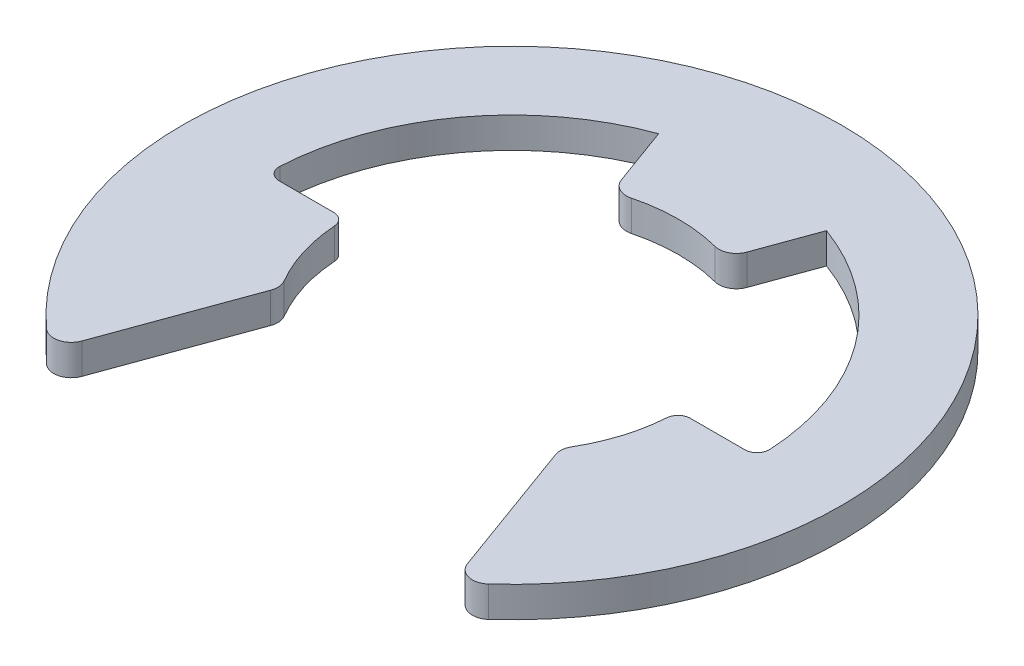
ISO-10303-21;
HEADER;
FILE_DESCRIPTION(('STEP AP214'),'2;1');
FILE_NAME('part.step','',(''),(''),'','','');
FILE_SCHEMA(('AUTOMOTIVE_DESIGN { 1 0 10303 214 1 1 1 1 }'));
ENDSEC;
DATA;
#1=APPLICATION_CONTEXT('core data for automotive mechanical design processes');
#2=APPLICATION_PROTOCOL_DEFINITION('international standard','automotive_design',2000,#1);
#3=PRODUCT_CONTEXT('',#1,'mechanical');
#4=PRODUCT('Part','Part','',(#3));
#5=PRODUCT_RELATED_PRODUCT_CATEGORY('part','',(#4));
#6=PRODUCT_DEFINITION_FORMATION('','',#4);
#7=PRODUCT_DEFINITION_CONTEXT('part definition',#1,'design');
#8=PRODUCT_DEFINITION('design','',#6,#7);
#9=PRODUCT_DEFINITION_SHAPE('','',#8);
#10=(LENGTH_UNIT() NAMED_UNIT(*) SI_UNIT(.MILLI.,.METRE.));
#11=(NAMED_UNIT(*) PLANE_ANGLE_UNIT() SI_UNIT($,.RADIAN.));
#12=(NAMED_UNIT(*) SI_UNIT($,.STERADIAN.) SOLID_ANGLE_UNIT());
#13=UNCERTAINTY_MEASURE_WITH_UNIT(LENGTH_MEASURE(1.E-05),#10,'distance_accuracy_value','');
#14=(GEOMETRIC_REPRESENTATION_CONTEXT(3) GLOBAL_UNCERTAINTY_ASSIGNED_CONTEXT((#13)) GLOBAL_UNIT_ASSIGNED_CONTEXT((#10,
#11,#12)) REPRESENTATION_CONTEXT('',''));
#15=CARTESIAN_POINT('',(0.,0.,0.));
#16=DIRECTION('',(0.,0.,1.));
#17=DIRECTION('',(1.,0.,0.));
#18=AXIS2_PLACEMENT_3D('',#15,#16,#17);
#19=CARTESIAN_POINT('',(0.,0.875,0.));
#20=DIRECTION('',(0.,-1.,0.));
#21=DIRECTION('',(0.,0.,-1.));
#22=AXIS2_PLACEMENT_3D('',#19,#20,#21);
#23=CYLINDRICAL_SURFACE('',#22,14.);
#24=CARTESIAN_POINT('',(0.,0.875,0.));
#25=DIRECTION('',(0.,-1.,0.));
#26=DIRECTION('',(0.,0.,1.));
#27=AXIS2_PLACEMENT_3D('',#24,#25,#26);
#28=CIRCLE('',#27,14.);
#29=CARTESIAN_POINT('',(-13.9805959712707,0.875,-0.736842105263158));
#30=VERTEX_POINT('',#29);
#31=CARTESIAN_POINT('',(-4.78828200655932,0.875,-13.1556966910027));
#32=VERTEX_POINT('',#31);
#33=EDGE_CURVE('E187',#30,#32,#28,.T.);
#34=ORIENTED_EDGE('',*,*,#33,.F.);
#35=DIRECTION('',(0.,-1.,0.));
#36=VECTOR('',#35,1.);
#37=CARTESIAN_POINT('',(-13.9805959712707,0.875,-0.736842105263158));
#38=LINE('',#37,#36);
#39=CARTESIAN_POINT('',(-13.9805959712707,-0.875,-0.736842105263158));
#40=VERTEX_POINT('',#39);
#41=EDGE_CURVE('E327',#30,#40,#38,.T.);
#42=ORIENTED_EDGE('',*,*,#41,.T.);
#43=CARTESIAN_POINT('',(0.,-0.875,0.));
#44=DIRECTION('',(0.,-1.,0.));
#45=DIRECTION('',(0.,0.,1.));
#46=AXIS2_PLACEMENT_3D('',#43,#44,#45);
#47=CIRCLE('',#46,14.);
#48=CARTESIAN_POINT('',(-4.78828200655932,-0.875,-13.1556966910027));
#49=VERTEX_POINT('',#48);
#50=EDGE_CURVE('E211',#40,#49,#47,.T.);
#51=ORIENTED_EDGE('',*,*,#50,.T.);
#52=DIRECTION('',(0.,-1.,0.));
#53=VECTOR('',#52,1.);
#54=CARTESIAN_POINT('',(-4.78828200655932,0.875,-13.1556966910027));
#55=LINE('',#54,#53);
#56=EDGE_CURVE('E204',#32,#49,#55,.T.);
#57=ORIENTED_EDGE('',*,*,#56,.F.);
#58=EDGE_LOOP('',(#34,#42,#51,#57));
#59=FACE_BOUND('',#58,.T.);
#60=ADVANCED_FACE('F39',(#59),#23,.F.);
#61=CARTESIAN_POINT('',(-4.78828200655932,0.875,-13.1556966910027));
#62=DIRECTION('',(0.93969262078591,0.,-0.342020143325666));
#63=DIRECTION('',(-0.342020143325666,0.,-0.93969262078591));
#64=AXIS2_PLACEMENT_3D('',#61,#62,#63);
#65=PLANE('',#64);
#66=DIRECTION('',(0.342020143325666,0.,0.93969262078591));
#67=VECTOR('',#66,1.);
#68=CARTESIAN_POINT('',(-4.78828200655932,-0.875,-13.1556966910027));
#69=LINE('',#68,#67);
#70=CARTESIAN_POINT('',(-3.57488773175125,-0.875,-9.82192332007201));
#71=VERTEX_POINT('',#70);
#72=EDGE_CURVE('E448',#49,#71,#69,.T.);
#73=ORIENTED_EDGE('',*,*,#72,.T.);
#74=DIRECTION('',(0.,-1.,0.));
#75=VECTOR('',#74,1.);
#76=CARTESIAN_POINT('',(-3.57488773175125,0.875,-9.82192332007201));
#77=LINE('',#76,#75);
#78=CARTESIAN_POINT('',(-3.57488773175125,0.875,-9.82192332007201));
#79=VERTEX_POINT('',#78);
#80=EDGE_CURVE('E206',#71,#79,#77,.F.);
#81=ORIENTED_EDGE('',*,*,#80,.T.);
#82=DIRECTION('',(0.342020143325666,0.,0.93969262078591));
#83=VECTOR('',#82,1.);
#84=CARTESIAN_POINT('',(-4.78828200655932,0.875,-13.1556966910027));
#85=LINE('',#84,#83);
#86=EDGE_CURVE('E191',#32,#79,#85,.T.);
#87=ORIENTED_EDGE('',*,*,#86,.F.);
#88=ORIENTED_EDGE('',*,*,#56,.T.);
#89=EDGE_LOOP('',(#73,#81,#87,#88));
#90=FACE_BOUND('',#89,.T.);
#91=ADVANCED_FACE('F203',(#90),#65,.F.);
#92=CARTESIAN_POINT('',(0.,0.875,0.));
#93=DIRECTION('',(0.,-1.,0.));
#94=DIRECTION('',(0.,0.,-1.));
#95=AXIS2_PLACEMENT_3D('',#92,#93,#94);
#96=CYLINDRICAL_SURFACE('',#95,9.5);
#97=CARTESIAN_POINT('',(0.,-0.875,0.));
#98=DIRECTION('',(0.,-1.,0.));
#99=DIRECTION('',(0.,0.,1.));
#100=AXIS2_PLACEMENT_3D('',#97,#98,#99);
#101=CIRCLE('',#100,9.5);
#102=CARTESIAN_POINT('',(-2.38422414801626,-0.875,-9.19594884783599));
#103=VERTEX_POINT('',#102);
#104=CARTESIAN_POINT('',(2.38422414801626,-0.875,-9.19594884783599));
#105=VERTEX_POINT('',#104);
#106=EDGE_CURVE('E451',#103,#105,#101,.T.);
#107=ORIENTED_EDGE('',*,*,#106,.T.);
#108=DIRECTION('',(0.,-1.,0.));
#109=VECTOR('',#108,1.);
#110=CARTESIAN_POINT('',(2.38422414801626,0.875,-9.19594884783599));
#111=LINE('',#110,#109);
#112=CARTESIAN_POINT('',(2.38422414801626,0.875,-9.19594884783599));
#113=VERTEX_POINT('',#112);
#114=EDGE_CURVE('E289',#105,#113,#111,.F.);
#115=ORIENTED_EDGE('',*,*,#114,.T.);
#116=CARTESIAN_POINT('',(0.,0.875,0.));
#117=DIRECTION('',(0.,-1.,0.));
#118=DIRECTION('',(0.,0.,1.));
#119=AXIS2_PLACEMENT_3D('',#116,#117,#118);
#120=CIRCLE('',#119,9.5);
#121=CARTESIAN_POINT('',(-2.38422414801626,0.875,-9.19594884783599));
#122=VERTEX_POINT('',#121);
#123=EDGE_CURVE('E208',#122,#113,#120,.T.);
#124=ORIENTED_EDGE('',*,*,#123,.F.);
#125=DIRECTION('',(0.,-1.,0.));
#126=VECTOR('',#125,1.);
#127=CARTESIAN_POINT('',(-2.38422414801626,0.875,-9.19594884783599));
#128=LINE('',#127,#126);
#129=EDGE_CURVE('E285',#122,#103,#128,.T.);
#130=ORIENTED_EDGE('',*,*,#129,.T.);
#131=EDGE_LOOP('',(#107,#115,#124,#130));
#132=FACE_BOUND('',#131,.T.);
#133=ADVANCED_FACE('F371',(#132),#96,.F.);
#134=CARTESIAN_POINT('',(3.24919136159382,0.875,-8.92707989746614));
#135=DIRECTION('',(-0.93969262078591,0.,-0.342020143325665));
#136=DIRECTION('',(-0.342020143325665,0.,0.93969262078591));
#137=AXIS2_PLACEMENT_3D('',#134,#135,#136);
#138=PLANE('',#137);
#139=DIRECTION('',(0.342020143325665,0.,-0.93969262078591));
#140=VECTOR('',#139,1.);
#141=CARTESIAN_POINT('',(3.24919136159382,0.875,-8.92707989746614));
#142=LINE('',#141,#140);
#143=CARTESIAN_POINT('',(3.57488773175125,0.875,-9.82192332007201));
#144=VERTEX_POINT('',#143);
#145=CARTESIAN_POINT('',(4.78828200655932,0.875,-13.1556966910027));
#146=VERTEX_POINT('',#145);
#147=EDGE_CURVE('E425',#144,#146,#142,.T.);
#148=ORIENTED_EDGE('',*,*,#147,.F.);
#149=DIRECTION('',(0.,-1.,0.));
#150=VECTOR('',#149,1.);
#151=CARTESIAN_POINT('',(3.57488773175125,0.875,-9.82192332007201));
#152=LINE('',#151,#150);
#153=CARTESIAN_POINT('',(3.57488773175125,-0.875,-9.82192332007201));
#154=VERTEX_POINT('',#153);
#155=EDGE_CURVE('E281',#144,#154,#152,.T.);
#156=ORIENTED_EDGE('',*,*,#155,.T.);
#157=DIRECTION('',(0.342020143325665,0.,-0.93969262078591));
#158=VECTOR('',#157,1.);
#159=CARTESIAN_POINT('',(3.24919136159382,-0.875,-8.92707989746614));
#160=LINE('',#159,#158);
#161=CARTESIAN_POINT('',(4.78828200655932,-0.875,-13.1556966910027));
#162=VERTEX_POINT('',#161);
#163=EDGE_CURVE('E454',#154,#162,#160,.T.);
#164=ORIENTED_EDGE('',*,*,#163,.T.);
#165=DIRECTION('',(0.,-1.,0.));
#166=VECTOR('',#165,1.);
#167=CARTESIAN_POINT('',(4.78828200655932,0.875,-13.1556966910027));
#168=LINE('',#167,#166);
#169=EDGE_CURVE('E215',#146,#162,#168,.T.);
#170=ORIENTED_EDGE('',*,*,#169,.F.);
#171=EDGE_LOOP('',(#148,#156,#164,#170));
#172=FACE_BOUND('',#171,.T.);
#173=ADVANCED_FACE('F527',(#172),#138,.F.);
#174=CARTESIAN_POINT('',(0.,0.875,0.));
#175=DIRECTION('',(0.,-1.,0.));
#176=DIRECTION('',(0.,0.,-1.));
#177=AXIS2_PLACEMENT_3D('',#174,#175,#176);
#178=CYLINDRICAL_SURFACE('',#177,14.);
#179=CARTESIAN_POINT('',(0.,-0.875,0.));
#180=DIRECTION('',(0.,-1.,0.));
#181=DIRECTION('',(0.,0.,1.));
#182=AXIS2_PLACEMENT_3D('',#179,#180,#181);
#183=CIRCLE('',#182,14.);
#184=CARTESIAN_POINT('',(13.9805959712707,-0.875,-0.736842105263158));
#185=VERTEX_POINT('',#184);
#186=EDGE_CURVE('E457',#162,#185,#183,.T.);
#187=ORIENTED_EDGE('',*,*,#186,.T.);
#188=DIRECTION('',(0.,-1.,0.));
#189=VECTOR('',#188,1.);
#190=CARTESIAN_POINT('',(13.9805959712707,0.875,-0.736842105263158));
#191=LINE('',#190,#189);
#192=CARTESIAN_POINT('',(13.9805959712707,0.875,-0.736842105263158));
#193=VERTEX_POINT('',#192);
#194=EDGE_CURVE('E308',#185,#193,#191,.F.);
#195=ORIENTED_EDGE('',*,*,#194,.T.);
#196=CARTESIAN_POINT('',(0.,0.875,0.));
#197=DIRECTION('',(0.,-1.,0.));
#198=DIRECTION('',(0.,0.,1.));
#199=AXIS2_PLACEMENT_3D('',#196,#197,#198);
#200=CIRCLE('',#199,14.);
#201=EDGE_CURVE('E411',#146,#193,#200,.T.);
#202=ORIENTED_EDGE('',*,*,#201,.F.);
#203=ORIENTED_EDGE('',*,*,#169,.T.);
#204=EDGE_LOOP('',(#187,#195,#202,#203));
#205=FACE_BOUND('',#204,.T.);
#206=ADVANCED_FACE('F521',(#205),#178,.F.);
#207=CARTESIAN_POINT('',(9.5,0.875,0.));
#208=DIRECTION('',(0.,0.,1.));
#209=DIRECTION('',(1.,0.,0.));
#210=AXIS2_PLACEMENT_3D('',#207,#208,#209);
#211=PLANE('',#210);
#212=DIRECTION('',(-1.,0.,0.));
#213=VECTOR('',#212,1.);
#214=CARTESIAN_POINT('',(9.5,0.875,0.));
#215=LINE('',#214,#213);
#216=CARTESIAN_POINT('',(13.2815661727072,0.875,0.));
#217=VERTEX_POINT('',#216);
#218=CARTESIAN_POINT('',(10.1759520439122,0.875,0.));
#219=VERTEX_POINT('',#218);
#220=EDGE_CURVE('E408',#217,#219,#215,.T.);
#221=ORIENTED_EDGE('',*,*,#220,.F.);
#222=DIRECTION('',(0.,1.,0.));
#223=VECTOR('',#222,1.);
#224=CARTESIAN_POINT('',(13.2815661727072,-0.875,0.));
#225=LINE('',#224,#223);
#226=CARTESIAN_POINT('',(13.2815661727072,-0.875,0.));
#227=VERTEX_POINT('',#226);
#228=EDGE_CURVE('E304',#217,#227,#225,.F.);
#229=ORIENTED_EDGE('',*,*,#228,.T.);
#230=DIRECTION('',(-1.,0.,0.));
#231=VECTOR('',#230,1.);
#232=CARTESIAN_POINT('',(9.5,-0.875,0.));
#233=LINE('',#232,#231);
#234=CARTESIAN_POINT('',(10.1759520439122,-0.875,0.));
#235=VERTEX_POINT('',#234);
#236=EDGE_CURVE('E460',#227,#235,#233,.T.);
#237=ORIENTED_EDGE('',*,*,#236,.T.);
#238=DIRECTION('',(0.,-1.,0.));
#239=VECTOR('',#238,1.);
#240=CARTESIAN_POINT('',(10.1759520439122,0.875,0.));
#241=LINE('',#240,#239);
#242=EDGE_CURVE('E301',#235,#219,#241,.F.);
#243=ORIENTED_EDGE('',*,*,#242,.T.);
#244=EDGE_LOOP('',(#221,#229,#237,#243));
#245=FACE_BOUND('',#244,.T.);
#246=ADVANCED_FACE('F413',(#245),#211,.F.);
#247=CARTESIAN_POINT('',(0.,0.875,0.));
#248=DIRECTION('',(0.,-1.,0.));
#249=DIRECTION('',(0.,0.,-1.));
#250=AXIS2_PLACEMENT_3D('',#247,#248,#249);
#251=CYLINDRICAL_SURFACE('',#250,9.5);
#252=CARTESIAN_POINT('',(0.,0.875,0.));
#253=DIRECTION('',(0.,-1.,0.));
#254=DIRECTION('',(0.,0.,1.));
#255=AXIS2_PLACEMENT_3D('',#252,#253,#254);
#256=CIRCLE('',#255,9.5);
#257=CARTESIAN_POINT('',(9.47760239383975,0.875,0.651960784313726));
#258=VERTEX_POINT('',#257);
#259=CARTESIAN_POINT('',(8.20188930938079,0.875,4.79364284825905));
#260=VERTEX_POINT('',#259);
#261=EDGE_CURVE('E418',#258,#260,#256,.T.);
#262=ORIENTED_EDGE('',*,*,#261,.F.);
#263=DIRECTION('',(0.,-1.,0.));
#264=VECTOR('',#263,1.);
#265=CARTESIAN_POINT('',(9.47760239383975,0.875,0.651960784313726));
#266=LINE('',#265,#264);
#267=CARTESIAN_POINT('',(9.47760239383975,-0.875,0.651960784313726));
#268=VERTEX_POINT('',#267);
#269=EDGE_CURVE('E311',#258,#268,#266,.T.);
#270=ORIENTED_EDGE('',*,*,#269,.T.);
#271=CARTESIAN_POINT('',(0.,-0.875,0.));
#272=DIRECTION('',(0.,-1.,0.));
#273=DIRECTION('',(0.,0.,1.));
#274=AXIS2_PLACEMENT_3D('',#271,#272,#273);
#275=CIRCLE('',#274,9.5);
#276=CARTESIAN_POINT('',(8.20188930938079,-0.875,4.79364284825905));
#277=VERTEX_POINT('',#276);
#278=EDGE_CURVE('E463',#268,#277,#275,.T.);
#279=ORIENTED_EDGE('',*,*,#278,.T.);
#280=DIRECTION('',(0.,-1.,0.));
#281=VECTOR('',#280,1.);
#282=CARTESIAN_POINT('',(8.20188930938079,0.875,4.79364284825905));
#283=LINE('',#282,#281);
#284=EDGE_CURVE('E250',#277,#260,#283,.F.);
#285=ORIENTED_EDGE('',*,*,#284,.T.);
#286=EDGE_LOOP('',(#262,#270,#279,#285));
#287=FACE_BOUND('',#286,.T.);
#288=ADVANCED_FACE('F512',(#287),#251,.F.);
#289=CARTESIAN_POINT('',(7.95999999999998,0.875,5.18540258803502));
#290=DIRECTION('',(0.939692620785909,0.,-0.342020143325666));
#291=DIRECTION('',(-0.342020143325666,0.,-0.93969262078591));
#292=AXIS2_PLACEMENT_3D('',#289,#290,#291);
#293=PLANE('',#292);
#294=DIRECTION('',(0.342020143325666,0.,0.939692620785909));
#295=VECTOR('',#294,1.);
#296=CARTESIAN_POINT('',(7.95999999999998,0.875,5.18540258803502));
#297=LINE('',#296,#295);
#298=CARTESIAN_POINT('',(8.12555345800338,0.875,5.64025697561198));
#299=VERTEX_POINT('',#298);
#300=CARTESIAN_POINT('',(11.0016273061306,0.875,13.5422049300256));
#301=VERTEX_POINT('',#300);
#302=EDGE_CURVE('E422',#299,#301,#297,.T.);
#303=ORIENTED_EDGE('',*,*,#302,.F.);
#304=DIRECTION('',(0.,-1.,0.));
#305=VECTOR('',#304,1.);
#306=CARTESIAN_POINT('',(8.12555345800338,0.875,5.64025697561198));
#307=LINE('',#306,#305);
#308=CARTESIAN_POINT('',(8.12555345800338,-0.875,5.64025697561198));
#309=VERTEX_POINT('',#308);
#310=EDGE_CURVE('E220',#299,#309,#307,.T.);
#311=ORIENTED_EDGE('',*,*,#310,.T.);
#312=DIRECTION('',(0.342020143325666,0.,0.939692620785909));
#313=VECTOR('',#312,1.);
#314=CARTESIAN_POINT('',(7.95999999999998,-0.875,5.18540258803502));
#315=LINE('',#314,#313);
#316=CARTESIAN_POINT('',(11.0016273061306,-0.875,13.5422049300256));
#317=VERTEX_POINT('',#316);
#318=EDGE_CURVE('E466',#309,#317,#315,.T.);
#319=ORIENTED_EDGE('',*,*,#318,.T.);
#320=DIRECTION('',(0.,-1.,0.));
#321=VECTOR('',#320,1.);
#322=CARTESIAN_POINT('',(11.0016273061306,0.875,13.5422049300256));
#323=LINE('',#322,#321);
#324=EDGE_CURVE('E214',#317,#301,#323,.F.);
#325=ORIENTED_EDGE('',*,*,#324,.T.);
#326=EDGE_LOOP('',(#303,#311,#319,#325));
#327=FACE_BOUND('',#326,.T.);
#328=ADVANCED_FACE('F506',(#327),#293,.F.);
#329=CARTESIAN_POINT('',(0.,0.875,0.));
#330=DIRECTION('',(0.,-1.,0.));
#331=DIRECTION('',(0.,0.,-1.));
#332=AXIS2_PLACEMENT_3D('',#329,#330,#331);
#333=CYLINDRICAL_SURFACE('',#332,18.8);
#334=CARTESIAN_POINT('',(0.,0.875,0.));
#335=DIRECTION('',(0.,1.,0.));
#336=DIRECTION('',(0.,0.,1.));
#337=AXIS2_PLACEMENT_3D('',#334,#335,#336);
#338=CIRCLE('',#337,18.8);
#339=CARTESIAN_POINT('',(12.612180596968,0.875,13.9417682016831));
#340=VERTEX_POINT('',#339);
#341=CARTESIAN_POINT('',(-12.6121805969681,0.875,13.9417682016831));
#342=VERTEX_POINT('',#341);
#343=EDGE_CURVE('E432',#340,#342,#338,.T.);
#344=ORIENTED_EDGE('',*,*,#343,.F.);
#345=DIRECTION('',(0.,-1.,0.));
#346=VECTOR('',#345,1.);
#347=CARTESIAN_POINT('',(12.612180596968,0.875,13.9417682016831));
#348=LINE('',#347,#346);
#349=CARTESIAN_POINT('',(12.612180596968,-0.875,13.9417682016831));
#350=VERTEX_POINT('',#349);
#351=EDGE_CURVE('E297',#340,#350,#348,.T.);
#352=ORIENTED_EDGE('',*,*,#351,.T.);
#353=CARTESIAN_POINT('',(0.,-0.875,0.));
#354=DIRECTION('',(0.,1.,0.));
#355=DIRECTION('',(0.,0.,1.));
#356=AXIS2_PLACEMENT_3D('',#353,#354,#355);
#357=CIRCLE('',#356,18.8);
#358=CARTESIAN_POINT('',(-12.6121805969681,-0.875,13.9417682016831));
#359=VERTEX_POINT('',#358);
#360=EDGE_CURVE('E470',#350,#359,#357,.T.);
#361=ORIENTED_EDGE('',*,*,#360,.T.);
#362=DIRECTION('',(0.,-1.,0.));
#363=VECTOR('',#362,1.);
#364=CARTESIAN_POINT('',(-12.6121805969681,0.875,13.9417682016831));
#365=LINE('',#364,#363);
#366=EDGE_CURVE('E294',#359,#342,#365,.F.);
#367=ORIENTED_EDGE('',*,*,#366,.T.);
#368=EDGE_LOOP('',(#344,#352,#361,#367));
#369=FACE_BOUND('',#368,.T.);
#370=ADVANCED_FACE('F499',(#369),#333,.T.);
#371=CARTESIAN_POINT('',(-11.488916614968,0.875,14.8810213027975));
#372=DIRECTION('',(-0.939692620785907,0.,-0.342020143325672));
#373=DIRECTION('',(-0.342020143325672,0.,0.939692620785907));
#374=AXIS2_PLACEMENT_3D('',#371,#372,#373);
#375=PLANE('',#374);
#376=DIRECTION('',(0.342020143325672,0.,-0.939692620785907));
#377=VECTOR('',#376,1.);
#378=CARTESIAN_POINT('',(-11.488916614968,-0.875,14.8810213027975));
#379=LINE('',#378,#377);
#380=CARTESIAN_POINT('',(-11.0016273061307,-0.875,13.5422049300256));
#381=VERTEX_POINT('',#380);
#382=CARTESIAN_POINT('',(-8.12555345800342,-0.875,5.64025697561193));
#383=VERTEX_POINT('',#382);
#384=EDGE_CURVE('E474',#381,#383,#379,.T.);
#385=ORIENTED_EDGE('',*,*,#384,.T.);
#386=DIRECTION('',(0.,-1.,0.));
#387=VECTOR('',#386,1.);
#388=CARTESIAN_POINT('',(-8.12555345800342,0.875,5.64025697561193));
#389=LINE('',#388,#387);
#390=CARTESIAN_POINT('',(-8.12555345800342,0.875,5.64025697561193));
#391=VERTEX_POINT('',#390);
#392=EDGE_CURVE('E278',#383,#391,#389,.F.);
#393=ORIENTED_EDGE('',*,*,#392,.T.);
#394=DIRECTION('',(0.342020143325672,0.,-0.939692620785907));
#395=VECTOR('',#394,1.);
#396=CARTESIAN_POINT('',(-11.488916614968,0.875,14.8810213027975));
#397=LINE('',#396,#395);
#398=CARTESIAN_POINT('',(-11.0016273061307,0.875,13.5422049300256));
#399=VERTEX_POINT('',#398);
#400=EDGE_CURVE('E436',#399,#391,#397,.T.);
#401=ORIENTED_EDGE('',*,*,#400,.F.);
#402=DIRECTION('',(0.,-1.,0.));
#403=VECTOR('',#402,1.);
#404=CARTESIAN_POINT('',(-11.0016273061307,0.875,13.5422049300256));
#405=LINE('',#404,#403);
#406=EDGE_CURVE('E274',#399,#381,#405,.T.);
#407=ORIENTED_EDGE('',*,*,#406,.T.);
#408=EDGE_LOOP('',(#385,#393,#401,#407));
#409=FACE_BOUND('',#408,.T.);
#410=ADVANCED_FACE('F491',(#409),#375,.F.);
#411=CARTESIAN_POINT('',(0.,0.875,0.));
#412=DIRECTION('',(0.,-1.,0.));
#413=DIRECTION('',(0.,0.,-1.));
#414=AXIS2_PLACEMENT_3D('',#411,#412,#413);
#415=CYLINDRICAL_SURFACE('',#414,9.5);
#416=CARTESIAN_POINT('',(0.,-0.875,0.));
#417=DIRECTION('',(0.,-1.,0.));
#418=DIRECTION('',(0.,0.,1.));
#419=AXIS2_PLACEMENT_3D('',#416,#417,#418);
#420=CIRCLE('',#419,9.5);
#421=CARTESIAN_POINT('',(-8.20188930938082,-0.875,4.793642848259));
#422=VERTEX_POINT('',#421);
#423=CARTESIAN_POINT('',(-9.47760239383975,-0.875,0.651960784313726));
#424=VERTEX_POINT('',#423);
#425=EDGE_CURVE('E354',#422,#424,#420,.T.);
#426=ORIENTED_EDGE('',*,*,#425,.T.);
#427=DIRECTION('',(0.,-1.,0.));
#428=VECTOR('',#427,1.);
#429=CARTESIAN_POINT('',(-9.47760239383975,0.875,0.651960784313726));
#430=LINE('',#429,#428);
#431=CARTESIAN_POINT('',(-9.47760239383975,0.875,0.651960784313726));
#432=VERTEX_POINT('',#431);
#433=EDGE_CURVE('E336',#424,#432,#430,.F.);
#434=ORIENTED_EDGE('',*,*,#433,.T.);
#435=CARTESIAN_POINT('',(0.,0.875,0.));
#436=DIRECTION('',(0.,-1.,0.));
#437=DIRECTION('',(0.,0.,1.));
#438=AXIS2_PLACEMENT_3D('',#435,#436,#437);
#439=CIRCLE('',#438,9.5);
#440=CARTESIAN_POINT('',(-8.20188930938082,0.875,4.793642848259));
#441=VERTEX_POINT('',#440);
#442=EDGE_CURVE('E440',#441,#432,#439,.T.);
#443=ORIENTED_EDGE('',*,*,#442,.F.);
#444=DIRECTION('',(0.,-1.,0.));
#445=VECTOR('',#444,1.);
#446=CARTESIAN_POINT('',(-8.20188930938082,0.875,4.793642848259));
#447=LINE('',#446,#445);
#448=EDGE_CURVE('E270',#441,#422,#447,.T.);
#449=ORIENTED_EDGE('',*,*,#448,.T.);
#450=EDGE_LOOP('',(#426,#434,#443,#449));
#451=FACE_BOUND('',#450,.T.);
#452=ADVANCED_FACE('F483',(#451),#415,.F.);
#453=CARTESIAN_POINT('',(-9.5,0.875,0.));
#454=DIRECTION('',(0.,0.,1.));
#455=DIRECTION('',(1.,0.,0.));
#456=AXIS2_PLACEMENT_3D('',#453,#454,#455);
#457=PLANE('',#456);
#458=DIRECTION('',(-1.,0.,0.));
#459=VECTOR('',#458,1.);
#460=CARTESIAN_POINT('',(-9.5,-0.875,0.));
#461=LINE('',#460,#459);
#462=CARTESIAN_POINT('',(-10.1759520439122,-0.875,0.));
#463=VERTEX_POINT('',#462);
#464=CARTESIAN_POINT('',(-13.2815661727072,-0.875,0.));
#465=VERTEX_POINT('',#464);
#466=EDGE_CURVE('E198',#463,#465,#461,.T.);
#467=ORIENTED_EDGE('',*,*,#466,.T.);
#468=DIRECTION('',(0.,1.,0.));
#469=VECTOR('',#468,1.);
#470=CARTESIAN_POINT('',(-13.2815661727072,0.875,0.));
#471=LINE('',#470,#469);
#472=CARTESIAN_POINT('',(-13.2815661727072,0.875,0.));
#473=VERTEX_POINT('',#472);
#474=EDGE_CURVE('E61',#465,#473,#471,.T.);
#475=ORIENTED_EDGE('',*,*,#474,.T.);
#476=DIRECTION('',(-1.,0.,0.));
#477=VECTOR('',#476,1.);
#478=CARTESIAN_POINT('',(-9.5,0.875,0.));
#479=LINE('',#478,#477);
#480=CARTESIAN_POINT('',(-10.1759520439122,0.875,0.));
#481=VERTEX_POINT('',#480);
#482=EDGE_CURVE('E224',#481,#473,#479,.T.);
#483=ORIENTED_EDGE('',*,*,#482,.F.);
#484=DIRECTION('',(0.,-1.,0.));
#485=VECTOR('',#484,1.);
#486=CARTESIAN_POINT('',(-10.1759520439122,0.875,0.));
#487=LINE('',#486,#485);
#488=EDGE_CURVE('E330',#481,#463,#487,.T.);
#489=ORIENTED_EDGE('',*,*,#488,.T.);
#490=EDGE_LOOP('',(#467,#475,#483,#489));
#491=FACE_BOUND('',#490,.T.);
#492=ADVANCED_FACE('F352',(#491),#457,.F.);
#493=CARTESIAN_POINT('',(0.,0.875,0.));
#494=DIRECTION('',(0.,1.,0.));
#495=DIRECTION('',(0.,0.,1.));
#496=AXIS2_PLACEMENT_3D('',#493,#494,#495);
#497=PLANE('',#496);
#498=ORIENTED_EDGE('',*,*,#220,.T.);
#499=CARTESIAN_POINT('',(10.1759520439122,0.875,0.7));
#500=DIRECTION('',(0.,1.,0.));
#501=DIRECTION('',(0.,0.,1.));
#502=AXIS2_PLACEMENT_3D('',#499,#500,#501);
#503=CIRCLE('',#502,0.7);
#504=EDGE_CURVE('E324',#219,#258,#503,.T.);
#505=ORIENTED_EDGE('',*,*,#504,.T.);
#506=ORIENTED_EDGE('',*,*,#261,.T.);
#507=CARTESIAN_POINT('',(9.06524607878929,0.875,5.29823683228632));
#508=DIRECTION('',(0.,1.,0.));
#509=DIRECTION('',(0.,0.,1.));
#510=AXIS2_PLACEMENT_3D('',#507,#508,#509);
#511=CIRCLE('',#510,1.);
#512=EDGE_CURVE('E267',#260,#299,#511,.T.);
#513=ORIENTED_EDGE('',*,*,#512,.T.);
#514=ORIENTED_EDGE('',*,*,#302,.T.);
#515=CARTESIAN_POINT('',(11.9413199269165,0.875,13.2001847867));
#516=DIRECTION('',(0.,1.,0.));
#517=DIRECTION('',(0.,0.,1.));
#518=AXIS2_PLACEMENT_3D('',#515,#516,#517);
#519=CIRCLE('',#518,1.);
#520=EDGE_CURVE('E256',#301,#340,#519,.T.);
#521=ORIENTED_EDGE('',*,*,#520,.T.);
#522=ORIENTED_EDGE('',*,*,#343,.T.);
#523=CARTESIAN_POINT('',(-11.9413199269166,0.875,13.2001847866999));
#524=DIRECTION('',(0.,1.,0.));
#525=DIRECTION('',(0.,0.,1.));
#526=AXIS2_PLACEMENT_3D('',#523,#524,#525);
#527=CIRCLE('',#526,1.);
#528=EDGE_CURVE('E253',#342,#399,#527,.T.);
#529=ORIENTED_EDGE('',*,*,#528,.T.);
#530=ORIENTED_EDGE('',*,*,#400,.T.);
#531=CARTESIAN_POINT('',(-9.06524607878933,0.875,5.29823683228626));
#532=DIRECTION('',(0.,1.,0.));
#533=DIRECTION('',(0.,0.,1.));
#534=AXIS2_PLACEMENT_3D('',#531,#532,#533);
#535=CIRCLE('',#534,1.);
#536=EDGE_CURVE('E264',#391,#441,#535,.T.);
#537=ORIENTED_EDGE('',*,*,#536,.T.);
#538=ORIENTED_EDGE('',*,*,#442,.T.);
#539=CARTESIAN_POINT('',(-10.1759520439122,0.875,0.7));
#540=DIRECTION('',(0.,1.,0.));
#541=DIRECTION('',(0.,0.,1.));
#542=AXIS2_PLACEMENT_3D('',#539,#540,#541);
#543=CIRCLE('',#542,0.7);
#544=EDGE_CURVE('E321',#432,#481,#543,.T.);
#545=ORIENTED_EDGE('',*,*,#544,.T.);
#546=ORIENTED_EDGE('',*,*,#482,.T.);
#547=CARTESIAN_POINT('',(-13.2815661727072,0.875,-0.7));
#548=DIRECTION('',(0.,1.,0.));
#549=DIRECTION('',(0.,0.,1.));
#550=AXIS2_PLACEMENT_3D('',#547,#548,#549);
#551=CIRCLE('',#550,0.7);
#552=EDGE_CURVE('E11',#473,#30,#551,.F.);
#553=ORIENTED_EDGE('',*,*,#552,.T.);
#554=ORIENTED_EDGE('',*,*,#33,.T.);
#555=ORIENTED_EDGE('',*,*,#86,.T.);
#556=CARTESIAN_POINT('',(-2.63519511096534,0.875,-10.1639434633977));
#557=DIRECTION('',(0.,1.,0.));
#558=DIRECTION('',(0.,0.,1.));
#559=AXIS2_PLACEMENT_3D('',#556,#557,#558);
#560=CIRCLE('',#559,1.);
#561=EDGE_CURVE('E259',#79,#122,#560,.T.);
#562=ORIENTED_EDGE('',*,*,#561,.T.);
#563=ORIENTED_EDGE('',*,*,#123,.T.);
#564=CARTESIAN_POINT('',(2.63519511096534,0.875,-10.1639434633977));
#565=DIRECTION('',(0.,1.,0.));
#566=DIRECTION('',(0.,0.,1.));
#567=AXIS2_PLACEMENT_3D('',#564,#565,#566);
#568=CIRCLE('',#567,1.);
#569=EDGE_CURVE('E261',#113,#144,#568,.T.);
#570=ORIENTED_EDGE('',*,*,#569,.T.);
#571=ORIENTED_EDGE('',*,*,#147,.T.);
#572=ORIENTED_EDGE('',*,*,#201,.T.);
#573=CARTESIAN_POINT('',(13.2815661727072,0.875,-0.7));
#574=DIRECTION('',(0.,1.,0.));
#575=DIRECTION('',(0.,0.,1.));
#576=AXIS2_PLACEMENT_3D('',#573,#574,#575);
#577=CIRCLE('',#576,0.7);
#578=EDGE_CURVE('E342',#193,#217,#577,.F.);
#579=ORIENTED_EDGE('',*,*,#578,.T.);
#580=EDGE_LOOP('',(#498,#505,#506,#513,#514,#521,#522,#529,#530,#537,#538,#545,#546,#553,#554,
#555,#562,#563,#570,#571,#572,#579));
#581=FACE_BOUND('',#580,.T.);
#582=ADVANCED_FACE('F190',(#581),#497,.T.);
#583=CARTESIAN_POINT('',(0.,-0.875,0.));
#584=DIRECTION('',(0.,1.,0.));
#585=DIRECTION('',(0.,0.,1.));
#586=AXIS2_PLACEMENT_3D('',#583,#584,#585);
#587=PLANE('',#586);
#588=ORIENTED_EDGE('',*,*,#278,.F.);
#589=CARTESIAN_POINT('',(10.1759520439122,-0.875,0.7));
#590=DIRECTION('',(0.,1.,0.));
#591=DIRECTION('',(0.,0.,1.));
#592=AXIS2_PLACEMENT_3D('',#589,#590,#591);
#593=CIRCLE('',#592,0.7);
#594=EDGE_CURVE('E318',#268,#235,#593,.F.);
#595=ORIENTED_EDGE('',*,*,#594,.T.);
#596=ORIENTED_EDGE('',*,*,#236,.F.);
#597=CARTESIAN_POINT('',(13.2815661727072,-0.875,-0.7));
#598=DIRECTION('',(0.,1.,0.));
#599=DIRECTION('',(0.,0.,1.));
#600=AXIS2_PLACEMENT_3D('',#597,#598,#599);
#601=CIRCLE('',#600,0.7);
#602=EDGE_CURVE('E339',#227,#185,#601,.T.);
#603=ORIENTED_EDGE('',*,*,#602,.T.);
#604=ORIENTED_EDGE('',*,*,#186,.F.);
#605=ORIENTED_EDGE('',*,*,#163,.F.);
#606=CARTESIAN_POINT('',(2.63519511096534,-0.875,-10.1639434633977));
#607=DIRECTION('',(0.,1.,0.));
#608=DIRECTION('',(0.,0.,1.));
#609=AXIS2_PLACEMENT_3D('',#606,#607,#608);
#610=CIRCLE('',#609,1.);
#611=EDGE_CURVE('E240',#154,#105,#610,.F.);
#612=ORIENTED_EDGE('',*,*,#611,.T.);
#613=ORIENTED_EDGE('',*,*,#106,.F.);
#614=CARTESIAN_POINT('',(-2.63519511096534,-0.875,-10.1639434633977));
#615=DIRECTION('',(0.,1.,0.));
#616=DIRECTION('',(0.,0.,1.));
#617=AXIS2_PLACEMENT_3D('',#614,#615,#616);
#618=CIRCLE('',#617,1.);
#619=EDGE_CURVE('E237',#103,#71,#618,.F.);
#620=ORIENTED_EDGE('',*,*,#619,.T.);
#621=ORIENTED_EDGE('',*,*,#72,.F.);
#622=ORIENTED_EDGE('',*,*,#50,.F.);
#623=CARTESIAN_POINT('',(-13.2815661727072,-0.875,-0.7));
#624=DIRECTION('',(0.,1.,0.));
#625=DIRECTION('',(0.,0.,1.));
#626=AXIS2_PLACEMENT_3D('',#623,#624,#625);
#627=CIRCLE('',#626,0.7);
#628=EDGE_CURVE('E48',#40,#465,#627,.T.);
#629=ORIENTED_EDGE('',*,*,#628,.T.);
#630=ORIENTED_EDGE('',*,*,#466,.F.);
#631=CARTESIAN_POINT('',(-10.1759520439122,-0.875,0.7));
#632=DIRECTION('',(0.,1.,0.));
#633=DIRECTION('',(0.,0.,1.));
#634=AXIS2_PLACEMENT_3D('',#631,#632,#633);
#635=CIRCLE('',#634,0.7);
#636=EDGE_CURVE('E315',#463,#424,#635,.F.);
#637=ORIENTED_EDGE('',*,*,#636,.T.);
#638=ORIENTED_EDGE('',*,*,#425,.F.);
#639=CARTESIAN_POINT('',(-9.06524607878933,-0.875,5.29823683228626));
#640=DIRECTION('',(0.,1.,0.));
#641=DIRECTION('',(0.,0.,1.));
#642=AXIS2_PLACEMENT_3D('',#639,#640,#641);
#643=CIRCLE('',#642,1.);
#644=EDGE_CURVE('E243',#422,#383,#643,.F.);
#645=ORIENTED_EDGE('',*,*,#644,.T.);
#646=ORIENTED_EDGE('',*,*,#384,.F.);
#647=CARTESIAN_POINT('',(-11.9413199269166,-0.875,13.2001847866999));
#648=DIRECTION('',(0.,1.,0.));
#649=DIRECTION('',(0.,0.,1.));
#650=AXIS2_PLACEMENT_3D('',#647,#648,#649);
#651=CIRCLE('',#650,1.);
#652=EDGE_CURVE('E231',#381,#359,#651,.F.);
#653=ORIENTED_EDGE('',*,*,#652,.T.);
#654=ORIENTED_EDGE('',*,*,#360,.F.);
#655=CARTESIAN_POINT('',(11.9413199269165,-0.875,13.2001847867));
#656=DIRECTION('',(0.,1.,0.));
#657=DIRECTION('',(0.,0.,1.));
#658=AXIS2_PLACEMENT_3D('',#655,#656,#657);
#659=CIRCLE('',#658,1.);
#660=EDGE_CURVE('E234',#350,#317,#659,.F.);
#661=ORIENTED_EDGE('',*,*,#660,.T.);
#662=ORIENTED_EDGE('',*,*,#318,.F.);
#663=CARTESIAN_POINT('',(9.06524607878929,-0.875,5.29823683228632));
#664=DIRECTION('',(0.,1.,0.));
#665=DIRECTION('',(0.,0.,1.));
#666=AXIS2_PLACEMENT_3D('',#663,#664,#665);
#667=CIRCLE('',#666,1.);
#668=EDGE_CURVE('E246',#309,#277,#667,.F.);
#669=ORIENTED_EDGE('',*,*,#668,.T.);
#670=EDGE_LOOP('',(#588,#595,#596,#603,#604,#605,#612,#613,#620,#621,#622,#629,#630,#637,#638,
#645,#646,#653,#654,#661,#662,#669));
#671=FACE_BOUND('',#670,.T.);
#672=ADVANCED_FACE('F350',(#671),#587,.F.);
#673=CARTESIAN_POINT('',(9.06524607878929,0.875,5.29823683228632));
#674=DIRECTION('',(0.,-1.,0.));
#675=DIRECTION('',(0.,0.,-1.));
#676=AXIS2_PLACEMENT_3D('',#673,#674,#675);
#677=CYLINDRICAL_SURFACE('',#676,1.);
#678=ORIENTED_EDGE('',*,*,#512,.F.);
#679=ORIENTED_EDGE('',*,*,#284,.F.);
#680=ORIENTED_EDGE('',*,*,#668,.F.);
#681=ORIENTED_EDGE('',*,*,#310,.F.);
#682=EDGE_LOOP('',(#678,#679,#680,#681));
#683=FACE_BOUND('',#682,.T.);
#684=ADVANCED_FACE('F375',(#683),#677,.T.);
#685=CARTESIAN_POINT('',(-9.06524607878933,0.875,5.29823683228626));
#686=DIRECTION('',(0.,-1.,0.));
#687=DIRECTION('',(0.,0.,-1.));
#688=AXIS2_PLACEMENT_3D('',#685,#686,#687);
#689=CYLINDRICAL_SURFACE('',#688,1.);
#690=ORIENTED_EDGE('',*,*,#536,.F.);
#691=ORIENTED_EDGE('',*,*,#392,.F.);
#692=ORIENTED_EDGE('',*,*,#644,.F.);
#693=ORIENTED_EDGE('',*,*,#448,.F.);
#694=EDGE_LOOP('',(#690,#691,#692,#693));
#695=FACE_BOUND('',#694,.T.);
#696=ADVANCED_FACE('F378',(#695),#689,.T.);
#697=CARTESIAN_POINT('',(2.63519511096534,0.875,-10.1639434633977));
#698=DIRECTION('',(0.,-1.,0.));
#699=DIRECTION('',(0.,0.,-1.));
#700=AXIS2_PLACEMENT_3D('',#697,#698,#699);
#701=CYLINDRICAL_SURFACE('',#700,1.);
#702=ORIENTED_EDGE('',*,*,#569,.F.);
#703=ORIENTED_EDGE('',*,*,#114,.F.);
#704=ORIENTED_EDGE('',*,*,#611,.F.);
#705=ORIENTED_EDGE('',*,*,#155,.F.);
#706=EDGE_LOOP('',(#702,#703,#704,#705));
#707=FACE_BOUND('',#706,.T.);
#708=ADVANCED_FACE('F382',(#707),#701,.T.);
#709=CARTESIAN_POINT('',(-2.63519511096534,0.875,-10.1639434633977));
#710=DIRECTION('',(0.,-1.,0.));
#711=DIRECTION('',(0.,0.,-1.));
#712=AXIS2_PLACEMENT_3D('',#709,#710,#711);
#713=CYLINDRICAL_SURFACE('',#712,1.);
#714=ORIENTED_EDGE('',*,*,#561,.F.);
#715=ORIENTED_EDGE('',*,*,#80,.F.);
#716=ORIENTED_EDGE('',*,*,#619,.F.);
#717=ORIENTED_EDGE('',*,*,#129,.F.);
#718=EDGE_LOOP('',(#714,#715,#716,#717));
#719=FACE_BOUND('',#718,.T.);
#720=ADVANCED_FACE('F386',(#719),#713,.T.);
#721=CARTESIAN_POINT('',(11.9413199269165,0.875,13.2001847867));
#722=DIRECTION('',(0.,-1.,0.));
#723=DIRECTION('',(0.,0.,-1.));
#724=AXIS2_PLACEMENT_3D('',#721,#722,#723);
#725=CYLINDRICAL_SURFACE('',#724,1.);
#726=ORIENTED_EDGE('',*,*,#520,.F.);
#727=ORIENTED_EDGE('',*,*,#324,.F.);
#728=ORIENTED_EDGE('',*,*,#660,.F.);
#729=ORIENTED_EDGE('',*,*,#351,.F.);
#730=EDGE_LOOP('',(#726,#727,#728,#729));
#731=FACE_BOUND('',#730,.T.);
#732=ADVANCED_FACE('F390',(#731),#725,.T.);
#733=CARTESIAN_POINT('',(-11.9413199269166,0.875,13.2001847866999));
#734=DIRECTION('',(0.,-1.,0.));
#735=DIRECTION('',(0.,0.,-1.));
#736=AXIS2_PLACEMENT_3D('',#733,#734,#735);
#737=CYLINDRICAL_SURFACE('',#736,1.);
#738=ORIENTED_EDGE('',*,*,#528,.F.);
#739=ORIENTED_EDGE('',*,*,#366,.F.);
#740=ORIENTED_EDGE('',*,*,#652,.F.);
#741=ORIENTED_EDGE('',*,*,#406,.F.);
#742=EDGE_LOOP('',(#738,#739,#740,#741));
#743=FACE_BOUND('',#742,.T.);
#744=ADVANCED_FACE('F394',(#743),#737,.T.);
#745=CARTESIAN_POINT('',(13.2815661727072,0.875,-0.7));
#746=DIRECTION('',(0.,-1.,0.));
#747=DIRECTION('',(0.,0.,-1.));
#748=AXIS2_PLACEMENT_3D('',#745,#746,#747);
#749=CYLINDRICAL_SURFACE('',#748,0.7);
#750=ORIENTED_EDGE('',*,*,#578,.F.);
#751=ORIENTED_EDGE('',*,*,#194,.F.);
#752=ORIENTED_EDGE('',*,*,#602,.F.);
#753=ORIENTED_EDGE('',*,*,#228,.F.);
#754=EDGE_LOOP('',(#750,#751,#752,#753));
#755=FACE_BOUND('',#754,.T.);
#756=ADVANCED_FACE('F363',(#755),#749,.F.);
#757=CARTESIAN_POINT('',(10.1759520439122,0.875,0.7));
#758=DIRECTION('',(0.,-1.,0.));
#759=DIRECTION('',(0.,0.,-1.));
#760=AXIS2_PLACEMENT_3D('',#757,#758,#759);
#761=CYLINDRICAL_SURFACE('',#760,0.7);
#762=ORIENTED_EDGE('',*,*,#504,.F.);
#763=ORIENTED_EDGE('',*,*,#242,.F.);
#764=ORIENTED_EDGE('',*,*,#594,.F.);
#765=ORIENTED_EDGE('',*,*,#269,.F.);
#766=EDGE_LOOP('',(#762,#763,#764,#765));
#767=FACE_BOUND('',#766,.T.);
#768=ADVANCED_FACE('F357',(#767),#761,.T.);
#769=CARTESIAN_POINT('',(-13.2815661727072,0.875,-0.7));
#770=DIRECTION('',(0.,-1.,0.));
#771=DIRECTION('',(0.,0.,-1.));
#772=AXIS2_PLACEMENT_3D('',#769,#770,#771);
#773=CYLINDRICAL_SURFACE('',#772,0.7);
#774=ORIENTED_EDGE('',*,*,#552,.F.);
#775=ORIENTED_EDGE('',*,*,#474,.F.);
#776=ORIENTED_EDGE('',*,*,#628,.F.);
#777=ORIENTED_EDGE('',*,*,#41,.F.);
#778=EDGE_LOOP('',(#774,#775,#776,#777));
#779=FACE_BOUND('',#778,.T.);
#780=ADVANCED_FACE('F355',(#779),#773,.F.);
#781=CARTESIAN_POINT('',(-10.1759520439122,0.875,0.7));
#782=DIRECTION('',(0.,-1.,0.));
#783=DIRECTION('',(0.,0.,-1.));
#784=AXIS2_PLACEMENT_3D('',#781,#782,#783);
#785=CYLINDRICAL_SURFACE('',#784,0.7);
#786=ORIENTED_EDGE('',*,*,#544,.F.);
#787=ORIENTED_EDGE('',*,*,#433,.F.);
#788=ORIENTED_EDGE('',*,*,#636,.F.);
#789=ORIENTED_EDGE('',*,*,#488,.F.);
#790=EDGE_LOOP('',(#786,#787,#788,#789));
#791=FACE_BOUND('',#790,.T.);
#792=ADVANCED_FACE('F41',(#791),#785,.T.);
#793=CLOSED_SHELL('',(#60,#91,#133,#173,#206,#246,#288,#328,#370,#410,#452,#492,#582,#672,#684,
#696,#708,#720,#732,#744,#756,#768,#780,#792));
#794=MANIFOLD_SOLID_BREP('B2',#793);
#795=ADVANCED_BREP_SHAPE_REPRESENTATION('',(#18,#794),#14);
#796=SHAPE_DEFINITION_REPRESENTATION(#9,#795);
ENDSEC;
END-ISO-10303-21;
